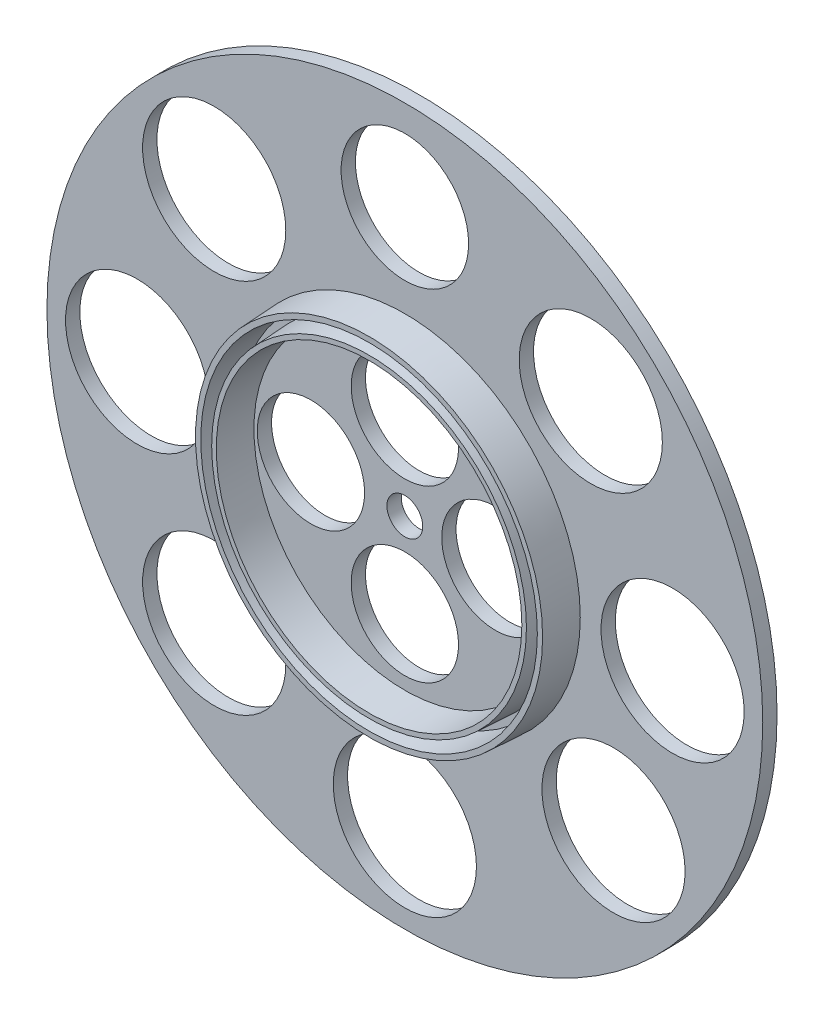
from build123d import *

# Parameters (mm, degrees)
SKETCH1_R           = 50
BOSS_EXTRUDE1_DEPTH = 2
SKETCH2_R           = 22.25
SKETCH2_R_2         = 21.081205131
BOSS_EXTRUDE2_DEPTH = 5
BOSS_EXTRUDE2_DRAFT = 3
SKETCH3_R           = 24.507667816
SKETCH3_R_2         = 23.25
BOSS_EXTRUDE3_DEPTH = 5
BOSS_EXTRUDE3_DRAFT = 3
SKETCH4_R           = 2.5
SKETCH4_R_2         = 7.5
SKETCH4_R_3         = 8.906744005
SKETCH4_R_4         = 10
CUT_EXTRUDE1_DEPTH  = 71.887234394


with BuildPart() as part:
    # Sketch1 → Boss-Extrude1 (new body)
    with BuildSketch(Plane.XY):
        Circle(SKETCH1_R)
    extrude(amount=BOSS_EXTRUDE1_DEPTH)


with BuildPart() as boss_extrude2_tool:
    # Sketch2 → Boss-Extrude2 (with draft: the straight prism first)
    with BuildSketch(Plane.XY.offset(2)):
        Circle(SKETCH2_R)
        Circle(SKETCH2_R_2, mode=Mode.SUBTRACT)
    extrude(amount=BOSS_EXTRUDE2_DEPTH)
    # Boss-Extrude2: the draft: its side faces are tilted about the plane it starts from
    boss_extrude2_sides = [boss_extrude2_tool.faces().sort_by_distance(p)[0] for p in [
        (-22.25, 0, 4.5),
        (-21.081205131, 0, 4.5),
    ]]
    draft(boss_extrude2_sides, Plane.XY.offset(2), BOSS_EXTRUDE2_DRAFT)


with BuildPart() as part_1:
    add(part.part)

    # Boss-Extrude2: add boss_extrude2_tool
    add(boss_extrude2_tool.part)


with BuildPart() as boss_extrude3_tool:
    # Sketch3 → Boss-Extrude3 (with draft: the straight prism first)
    with BuildSketch(Plane.XY.offset(2)):
        Circle(SKETCH3_R)
        Circle(SKETCH3_R_2, mode=Mode.SUBTRACT)
    extrude(amount=BOSS_EXTRUDE3_DEPTH)
    # Boss-Extrude3: the draft: its side faces are tilted about the plane it starts from
    boss_extrude3_sides = [boss_extrude3_tool.faces().sort_by_distance(p)[0] for p in [
        (-24.507667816, 0, 4.5),
        (-23.25, 0, 4.5),
    ]]
    draft(boss_extrude3_sides, Plane.XY.offset(2), BOSS_EXTRUDE3_DRAFT)


with BuildPart() as part_2:
    add(part_1.part)

    # Boss-Extrude3: add boss_extrude3_tool
    add(boss_extrude3_tool.part)

    # Sketch4 → Cut-Extrude1 (cut, through all)
    with BuildSketch(Plane.XY.offset(2)):
        Circle(SKETCH4_R)
        with Locations((0, 11.998671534)):
            Circle(SKETCH4_R_2)
        with Locations((0, 37.402108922)):
            Circle(SKETCH4_R_3)
        with Locations((-26.634184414, 26.259055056)):
            Circle(SKETCH4_R_4)
        with Locations((-37.402108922, 0)):
            Circle(SKETCH4_R_4)
        with Locations((0, -37.402108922)):
            Circle(SKETCH4_R_4)
        with Locations((37.402108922, 0)):
            Circle(SKETCH4_R_4)
        with Locations((25.974278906, 26.911978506)):
            Circle(SKETCH4_R_4)
        with Locations((29.151191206, -23.433433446)):
            Circle(SKETCH4_R_4)
        with Locations((-26.634184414, -26.259055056)):
            Circle(SKETCH4_R_4)
        with Locations((0, -11.811192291)):
            Circle(SKETCH4_R_2)
        with Locations((-13.12354699, 0)):
            Circle(SKETCH4_R_2)
        with Locations((12.654848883, 0)):
            Circle(SKETCH4_R_2)
    extrude(amount=-CUT_EXTRUDE1_DEPTH, mode=Mode.SUBTRACT)


solid = part_2.part
